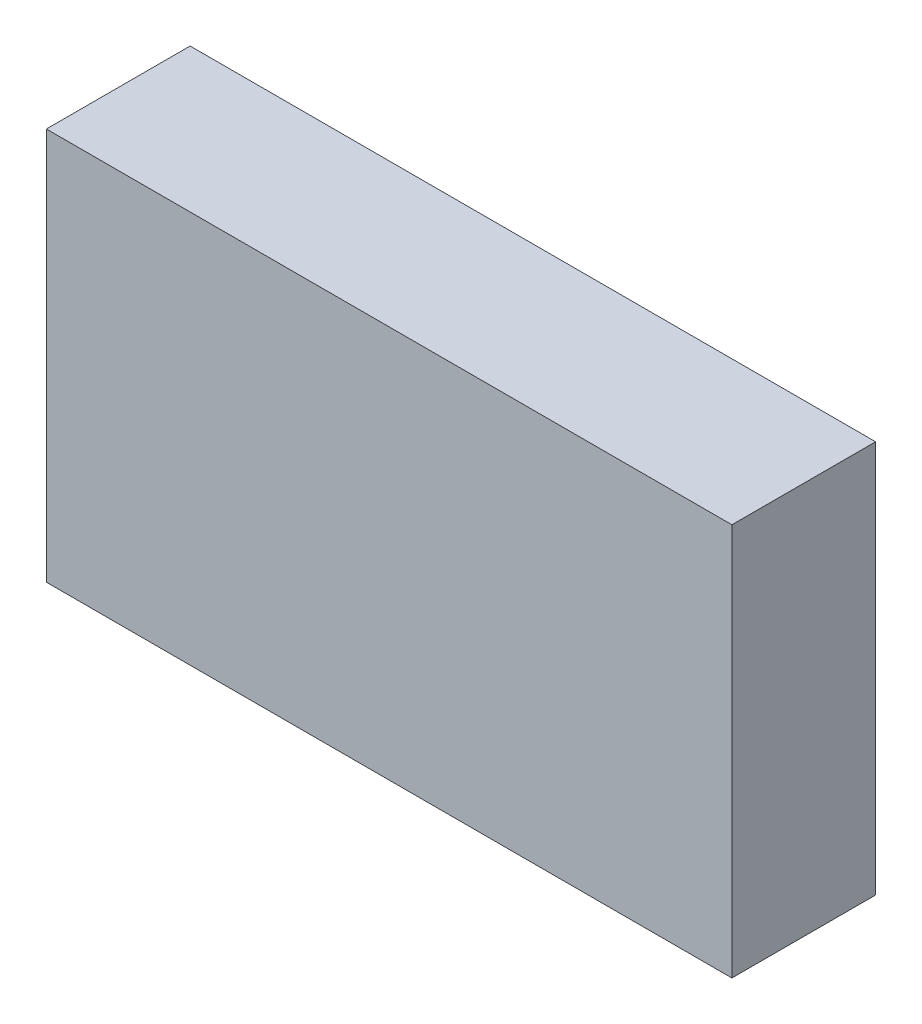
ISO-10303-21;
HEADER;
FILE_DESCRIPTION(('STEP AP214'),'2;1');
FILE_NAME('part.step','',(''),(''),'','','');
FILE_SCHEMA(('AUTOMOTIVE_DESIGN { 1 0 10303 214 1 1 1 1 }'));
ENDSEC;
DATA;
#1=APPLICATION_CONTEXT('core data for automotive mechanical design processes');
#2=APPLICATION_PROTOCOL_DEFINITION('international standard','automotive_design',2000,#1);
#3=PRODUCT_CONTEXT('',#1,'mechanical');
#4=PRODUCT('Part','Part','',(#3));
#5=PRODUCT_RELATED_PRODUCT_CATEGORY('part','',(#4));
#6=PRODUCT_DEFINITION_FORMATION('','',#4);
#7=PRODUCT_DEFINITION_CONTEXT('part definition',#1,'design');
#8=PRODUCT_DEFINITION('design','',#6,#7);
#9=PRODUCT_DEFINITION_SHAPE('','',#8);
#10=(LENGTH_UNIT() NAMED_UNIT(*) SI_UNIT(.MILLI.,.METRE.));
#11=(NAMED_UNIT(*) PLANE_ANGLE_UNIT() SI_UNIT($,.RADIAN.));
#12=(NAMED_UNIT(*) SI_UNIT($,.STERADIAN.) SOLID_ANGLE_UNIT());
#13=UNCERTAINTY_MEASURE_WITH_UNIT(LENGTH_MEASURE(1.E-05),#10,'distance_accuracy_value','');
#14=(GEOMETRIC_REPRESENTATION_CONTEXT(3) GLOBAL_UNCERTAINTY_ASSIGNED_CONTEXT((#13)) GLOBAL_UNIT_ASSIGNED_CONTEXT((#10,
#11,#12)) REPRESENTATION_CONTEXT('',''));
#15=CARTESIAN_POINT('',(0.,0.,0.));
#16=DIRECTION('',(0.,0.,1.));
#17=DIRECTION('',(1.,0.,0.));
#18=AXIS2_PLACEMENT_3D('',#15,#16,#17);
#19=CARTESIAN_POINT('',(3.09999888,-1.77500026,1.3));
#20=DIRECTION('',(0.,0.,-1.));
#21=DIRECTION('',(-1.,0.,0.));
#22=AXIS2_PLACEMENT_3D('',#19,#20,#21);
#23=PLANE('',#22);
#24=DIRECTION('',(1.,0.,0.));
#25=VECTOR('',#24,1.);
#26=CARTESIAN_POINT('',(3.09999888,1.77500026,1.3));
#27=LINE('',#26,#25);
#28=CARTESIAN_POINT('',(3.09999888,1.77500026,1.3));
#29=VERTEX_POINT('',#28);
#30=CARTESIAN_POINT('',(-3.09999888,1.77500026,1.3));
#31=VERTEX_POINT('',#30);
#32=EDGE_CURVE('E55',#29,#31,#27,.F.);
#33=ORIENTED_EDGE('',*,*,#32,.T.);
#34=DIRECTION('',(0.,1.,0.));
#35=VECTOR('',#34,1.);
#36=CARTESIAN_POINT('',(-3.09999888,1.77500026,1.3));
#37=LINE('',#36,#35);
#38=CARTESIAN_POINT('',(-3.09999888,-1.77500026,1.3));
#39=VERTEX_POINT('',#38);
#40=EDGE_CURVE('E57',#31,#39,#37,.F.);
#41=ORIENTED_EDGE('',*,*,#40,.T.);
#42=DIRECTION('',(1.,0.,0.));
#43=VECTOR('',#42,1.);
#44=CARTESIAN_POINT('',(-3.09999888,-1.77500026,1.3));
#45=LINE('',#44,#43);
#46=CARTESIAN_POINT('',(3.09999888,-1.77500026,1.3));
#47=VERTEX_POINT('',#46);
#48=EDGE_CURVE('E20',#39,#47,#45,.T.);
#49=ORIENTED_EDGE('',*,*,#48,.T.);
#50=DIRECTION('',(0.,1.,0.));
#51=VECTOR('',#50,1.);
#52=CARTESIAN_POINT('',(3.09999888,-1.77500026,1.3));
#53=LINE('',#52,#51);
#54=EDGE_CURVE('E80',#47,#29,#53,.T.);
#55=ORIENTED_EDGE('',*,*,#54,.T.);
#56=EDGE_LOOP('',(#33,#41,#49,#55));
#57=FACE_BOUND('',#56,.T.);
#58=ADVANCED_FACE('F17',(#57),#23,.F.);
#59=CARTESIAN_POINT('',(-3.09999888,-1.77500026,0.));
#60=DIRECTION('',(0.,1.,0.));
#61=DIRECTION('',(0.,0.,1.));
#62=AXIS2_PLACEMENT_3D('',#59,#60,#61);
#63=PLANE('',#62);
#64=DIRECTION('',(0.,0.,1.));
#65=VECTOR('',#64,1.);
#66=CARTESIAN_POINT('',(3.09999888,-1.77500026,0.));
#67=LINE('',#66,#65);
#68=CARTESIAN_POINT('',(3.09999888,-1.77500026,0.));
#69=VERTEX_POINT('',#68);
#70=EDGE_CURVE('E68',#69,#47,#67,.T.);
#71=ORIENTED_EDGE('',*,*,#70,.T.);
#72=ORIENTED_EDGE('',*,*,#48,.F.);
#73=DIRECTION('',(0.,0.,-1.));
#74=VECTOR('',#73,1.);
#75=CARTESIAN_POINT('',(-3.09999888,-1.77500026,0.));
#76=LINE('',#75,#74);
#77=CARTESIAN_POINT('',(-3.09999888,-1.77500026,0.));
#78=VERTEX_POINT('',#77);
#79=EDGE_CURVE('E63',#39,#78,#76,.T.);
#80=ORIENTED_EDGE('',*,*,#79,.T.);
#81=DIRECTION('',(-1.,0.,0.));
#82=VECTOR('',#81,1.);
#83=CARTESIAN_POINT('',(3.09999888,-1.77500026,0.));
#84=LINE('',#83,#82);
#85=EDGE_CURVE('E83',#69,#78,#84,.T.);
#86=ORIENTED_EDGE('',*,*,#85,.F.);
#87=EDGE_LOOP('',(#71,#72,#80,#86));
#88=FACE_BOUND('',#87,.T.);
#89=ADVANCED_FACE('F65',(#88),#63,.F.);
#90=CARTESIAN_POINT('',(-3.09999888,1.77500026,0.));
#91=DIRECTION('',(1.,0.,0.));
#92=DIRECTION('',(0.,0.,-1.));
#93=AXIS2_PLACEMENT_3D('',#90,#91,#92);
#94=PLANE('',#93);
#95=ORIENTED_EDGE('',*,*,#79,.F.);
#96=ORIENTED_EDGE('',*,*,#40,.F.);
#97=DIRECTION('',(0.,0.,-1.));
#98=VECTOR('',#97,1.);
#99=CARTESIAN_POINT('',(-3.09999888,1.77500026,0.));
#100=LINE('',#99,#98);
#101=CARTESIAN_POINT('',(-3.09999888,1.77500026,0.));
#102=VERTEX_POINT('',#101);
#103=EDGE_CURVE('E75',#31,#102,#100,.T.);
#104=ORIENTED_EDGE('',*,*,#103,.T.);
#105=DIRECTION('',(0.,1.,0.));
#106=VECTOR('',#105,1.);
#107=CARTESIAN_POINT('',(-3.09999888,-1.77500026,0.));
#108=LINE('',#107,#106);
#109=EDGE_CURVE('E72',#78,#102,#108,.T.);
#110=ORIENTED_EDGE('',*,*,#109,.F.);
#111=EDGE_LOOP('',(#95,#96,#104,#110));
#112=FACE_BOUND('',#111,.T.);
#113=ADVANCED_FACE('F70',(#112),#94,.F.);
#114=CARTESIAN_POINT('',(3.09999888,1.77500026,0.));
#115=DIRECTION('',(0.,-1.,0.));
#116=DIRECTION('',(0.,0.,-1.));
#117=AXIS2_PLACEMENT_3D('',#114,#115,#116);
#118=PLANE('',#117);
#119=ORIENTED_EDGE('',*,*,#103,.F.);
#120=ORIENTED_EDGE('',*,*,#32,.F.);
#121=DIRECTION('',(0.,0.,1.));
#122=VECTOR('',#121,1.);
#123=CARTESIAN_POINT('',(3.09999888,1.77500026,0.));
#124=LINE('',#123,#122);
#125=CARTESIAN_POINT('',(3.09999888,1.77500026,0.));
#126=VERTEX_POINT('',#125);
#127=EDGE_CURVE('E35',#29,#126,#124,.F.);
#128=ORIENTED_EDGE('',*,*,#127,.T.);
#129=DIRECTION('',(-1.,0.,0.));
#130=VECTOR('',#129,1.);
#131=CARTESIAN_POINT('',(3.09999888,1.77500026,0.));
#132=LINE('',#131,#130);
#133=EDGE_CURVE('E26',#102,#126,#132,.F.);
#134=ORIENTED_EDGE('',*,*,#133,.F.);
#135=EDGE_LOOP('',(#119,#120,#128,#134));
#136=FACE_BOUND('',#135,.T.);
#137=ADVANCED_FACE('F89',(#136),#118,.F.);
#138=CARTESIAN_POINT('',(3.09999888,-1.77500026,0.));
#139=DIRECTION('',(-1.,0.,0.));
#140=DIRECTION('',(0.,0.,1.));
#141=AXIS2_PLACEMENT_3D('',#138,#139,#140);
#142=PLANE('',#141);
#143=ORIENTED_EDGE('',*,*,#127,.F.);
#144=ORIENTED_EDGE('',*,*,#54,.F.);
#145=ORIENTED_EDGE('',*,*,#70,.F.);
#146=DIRECTION('',(0.,1.,0.));
#147=VECTOR('',#146,1.);
#148=CARTESIAN_POINT('',(3.09999888,-1.77500026,0.));
#149=LINE('',#148,#147);
#150=EDGE_CURVE('E11',#126,#69,#149,.F.);
#151=ORIENTED_EDGE('',*,*,#150,.F.);
#152=EDGE_LOOP('',(#143,#144,#145,#151));
#153=FACE_BOUND('',#152,.T.);
#154=ADVANCED_FACE('F91',(#153),#142,.F.);
#155=CARTESIAN_POINT('',(3.09999888,-1.77500026,0.));
#156=DIRECTION('',(0.,0.,-1.));
#157=DIRECTION('',(-1.,0.,0.));
#158=AXIS2_PLACEMENT_3D('',#155,#156,#157);
#159=PLANE('',#158);
#160=ORIENTED_EDGE('',*,*,#133,.T.);
#161=ORIENTED_EDGE('',*,*,#150,.T.);
#162=ORIENTED_EDGE('',*,*,#85,.T.);
#163=ORIENTED_EDGE('',*,*,#109,.T.);
#164=EDGE_LOOP('',(#160,#161,#162,#163));
#165=FACE_BOUND('',#164,.T.);
#166=ADVANCED_FACE('F88',(#165),#159,.T.);
#167=CLOSED_SHELL('',(#58,#89,#113,#137,#154,#166));
#168=MANIFOLD_SOLID_BREP('B1',#167);
#169=ADVANCED_BREP_SHAPE_REPRESENTATION('',(#18,#168),#14);
#170=SHAPE_DEFINITION_REPRESENTATION(#9,#169);
ENDSEC;
END-ISO-10303-21;
